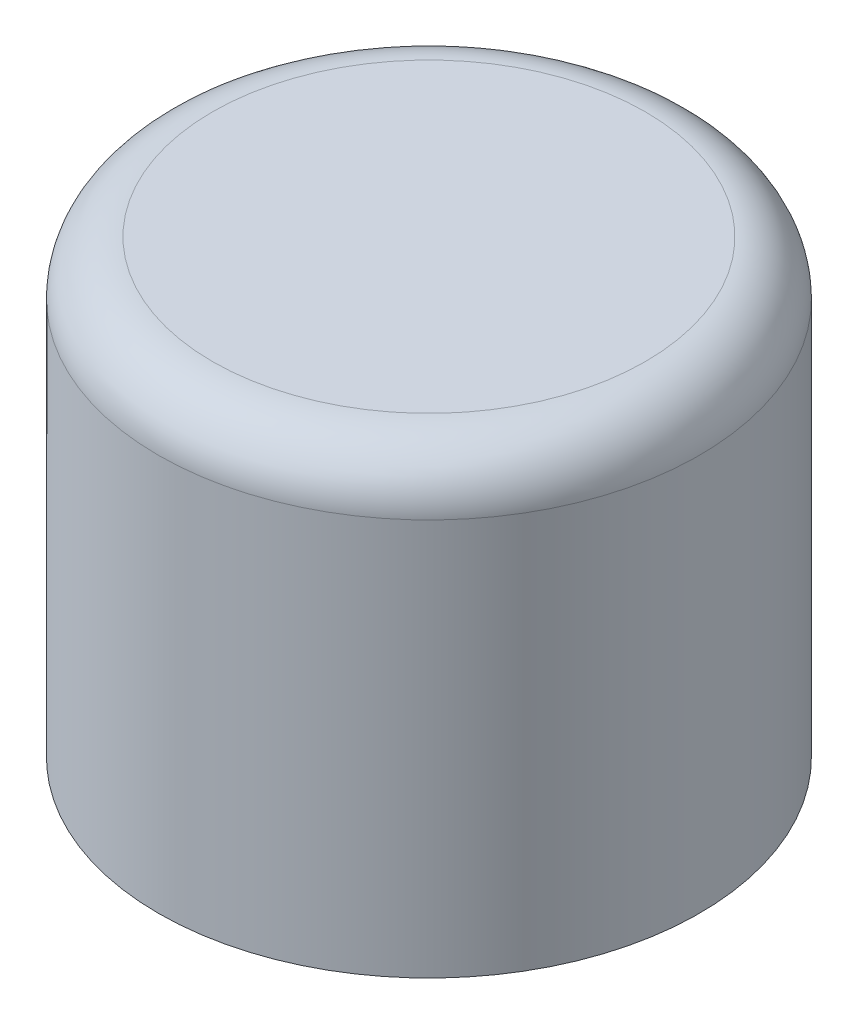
ISO-10303-21;
HEADER;
FILE_DESCRIPTION(('STEP AP214'),'2;1');
FILE_NAME('part.step','',(''),(''),'','','');
FILE_SCHEMA(('AUTOMOTIVE_DESIGN { 1 0 10303 214 1 1 1 1 }'));
ENDSEC;
DATA;
#1=APPLICATION_CONTEXT('core data for automotive mechanical design processes');
#2=APPLICATION_PROTOCOL_DEFINITION('international standard','automotive_design',2000,#1);
#3=PRODUCT_CONTEXT('',#1,'mechanical');
#4=PRODUCT('Part','Part','',(#3));
#5=PRODUCT_RELATED_PRODUCT_CATEGORY('part','',(#4));
#6=PRODUCT_DEFINITION_FORMATION('','',#4);
#7=PRODUCT_DEFINITION_CONTEXT('part definition',#1,'design');
#8=PRODUCT_DEFINITION('design','',#6,#7);
#9=PRODUCT_DEFINITION_SHAPE('','',#8);
#10=(LENGTH_UNIT() NAMED_UNIT(*) SI_UNIT(.MILLI.,.METRE.));
#11=(NAMED_UNIT(*) PLANE_ANGLE_UNIT() SI_UNIT($,.RADIAN.));
#12=(NAMED_UNIT(*) SI_UNIT($,.STERADIAN.) SOLID_ANGLE_UNIT());
#13=UNCERTAINTY_MEASURE_WITH_UNIT(LENGTH_MEASURE(1.E-05),#10,'distance_accuracy_value','');
#14=(GEOMETRIC_REPRESENTATION_CONTEXT(3) GLOBAL_UNCERTAINTY_ASSIGNED_CONTEXT((#13)) GLOBAL_UNIT_ASSIGNED_CONTEXT((#10,
#11,#12)) REPRESENTATION_CONTEXT('',''));
#15=CARTESIAN_POINT('',(0.,0.,0.));
#16=DIRECTION('',(0.,0.,1.));
#17=DIRECTION('',(1.,0.,0.));
#18=AXIS2_PLACEMENT_3D('',#15,#16,#17);
#19=CARTESIAN_POINT('',(0.,6.35,0.));
#20=DIRECTION('',(0.,-1.,0.));
#21=DIRECTION('',(0.,0.,-1.));
#22=AXIS2_PLACEMENT_3D('',#19,#20,#21);
#23=CYLINDRICAL_SURFACE('',#22,3.81);
#24=CARTESIAN_POINT('',(0.,5.588,0.));
#25=DIRECTION('',(0.,1.,0.));
#26=DIRECTION('',(0.,0.,1.));
#27=AXIS2_PLACEMENT_3D('',#24,#25,#26);
#28=CIRCLE('',#27,3.81);
#29=CARTESIAN_POINT('',(0.,5.588,3.81));
#30=VERTEX_POINT('',#29);
#31=EDGE_CURVE('E10',#30,#30,#28,.F.);
#32=ORIENTED_EDGE('',*,*,#31,.T.);
#33=EDGE_LOOP('',(#32));
#34=FACE_BOUND('',#33,.T.);
#35=CARTESIAN_POINT('',(0.,0.,0.));
#36=DIRECTION('',(0.,1.,0.));
#37=DIRECTION('',(0.,0.,1.));
#38=AXIS2_PLACEMENT_3D('',#35,#36,#37);
#39=CIRCLE('',#38,3.81);
#40=CARTESIAN_POINT('',(0.,0.,3.81));
#41=VERTEX_POINT('',#40);
#42=EDGE_CURVE('E40',#41,#41,#39,.T.);
#43=ORIENTED_EDGE('',*,*,#42,.T.);
#44=EDGE_LOOP('',(#43));
#45=FACE_BOUND('',#44,.T.);
#46=ADVANCED_FACE('F29',(#34,#45),#23,.T.);
#47=CARTESIAN_POINT('',(0.,6.35,0.));
#48=DIRECTION('',(0.,1.,0.));
#49=DIRECTION('',(0.,0.,1.));
#50=AXIS2_PLACEMENT_3D('',#47,#48,#49);
#51=PLANE('',#50);
#52=CARTESIAN_POINT('',(0.,6.35,0.));
#53=DIRECTION('',(0.,1.,0.));
#54=DIRECTION('',(0.,0.,1.));
#55=AXIS2_PLACEMENT_3D('',#52,#53,#54);
#56=CIRCLE('',#55,3.048);
#57=CARTESIAN_POINT('',(0.,6.35,3.048));
#58=VERTEX_POINT('',#57);
#59=EDGE_CURVE('E36',#58,#58,#56,.T.);
#60=ORIENTED_EDGE('',*,*,#59,.T.);
#61=EDGE_LOOP('',(#60));
#62=FACE_BOUND('',#61,.T.);
#63=ADVANCED_FACE('F50',(#62),#51,.T.);
#64=CARTESIAN_POINT('',(0.,0.,0.));
#65=DIRECTION('',(0.,1.,0.));
#66=DIRECTION('',(0.,0.,1.));
#67=AXIS2_PLACEMENT_3D('',#64,#65,#66);
#68=PLANE('',#67);
#69=ORIENTED_EDGE('',*,*,#42,.F.);
#70=EDGE_LOOP('',(#69));
#71=FACE_BOUND('',#70,.T.);
#72=ADVANCED_FACE('F48',(#71),#68,.F.);
#73=CARTESIAN_POINT('',(0.,5.588,0.));
#74=DIRECTION('',(0.,1.,0.));
#75=DIRECTION('',(0.,0.,1.));
#76=AXIS2_PLACEMENT_3D('',#73,#74,#75);
#77=TOROIDAL_SURFACE('',#76,3.048,0.762);
#78=ORIENTED_EDGE('',*,*,#31,.F.);
#79=EDGE_LOOP('',(#78));
#80=FACE_BOUND('',#79,.T.);
#81=ORIENTED_EDGE('',*,*,#59,.F.);
#82=EDGE_LOOP('',(#81));
#83=FACE_BOUND('',#82,.T.);
#84=ADVANCED_FACE('F31',(#80,#83),#77,.T.);
#85=CLOSED_SHELL('',(#46,#63,#72,#84));
#86=MANIFOLD_SOLID_BREP('B2',#85);
#87=ADVANCED_BREP_SHAPE_REPRESENTATION('',(#18,#86),#14);
#88=SHAPE_DEFINITION_REPRESENTATION(#9,#87);
ENDSEC;
END-ISO-10303-21;
